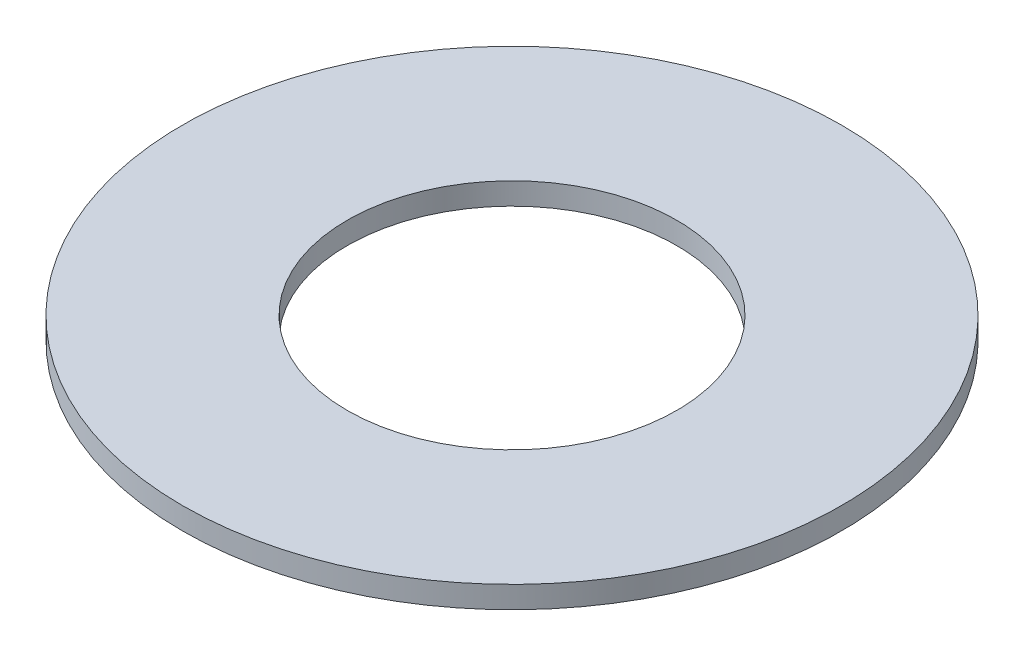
ISO-10303-21;
HEADER;
FILE_DESCRIPTION(('STEP AP214'),'2;1');
FILE_NAME('part.step','',(''),(''),'','','');
FILE_SCHEMA(('AUTOMOTIVE_DESIGN { 1 0 10303 214 1 1 1 1 }'));
ENDSEC;
DATA;
#1=APPLICATION_CONTEXT('core data for automotive mechanical design processes');
#2=APPLICATION_PROTOCOL_DEFINITION('international standard','automotive_design',2000,#1);
#3=PRODUCT_CONTEXT('',#1,'mechanical');
#4=PRODUCT('Part','Part','',(#3));
#5=PRODUCT_RELATED_PRODUCT_CATEGORY('part','',(#4));
#6=PRODUCT_DEFINITION_FORMATION('','',#4);
#7=PRODUCT_DEFINITION_CONTEXT('part definition',#1,'design');
#8=PRODUCT_DEFINITION('design','',#6,#7);
#9=PRODUCT_DEFINITION_SHAPE('','',#8);
#10=(LENGTH_UNIT() NAMED_UNIT(*) SI_UNIT(.MILLI.,.METRE.));
#11=(NAMED_UNIT(*) PLANE_ANGLE_UNIT() SI_UNIT($,.RADIAN.));
#12=(NAMED_UNIT(*) SI_UNIT($,.STERADIAN.) SOLID_ANGLE_UNIT());
#13=UNCERTAINTY_MEASURE_WITH_UNIT(LENGTH_MEASURE(1.E-05),#10,'distance_accuracy_value','');
#14=(GEOMETRIC_REPRESENTATION_CONTEXT(3) GLOBAL_UNCERTAINTY_ASSIGNED_CONTEXT((#13)) GLOBAL_UNIT_ASSIGNED_CONTEXT((#10,
#11,#12)) REPRESENTATION_CONTEXT('',''));
#15=CARTESIAN_POINT('',(0.,0.,0.));
#16=DIRECTION('',(0.,0.,1.));
#17=DIRECTION('',(1.,0.,0.));
#18=AXIS2_PLACEMENT_3D('',#15,#16,#17);
#19=CARTESIAN_POINT('',(0.,0.2,0.));
#20=DIRECTION('',(0.,1.,0.));
#21=DIRECTION('',(0.,0.,1.));
#22=AXIS2_PLACEMENT_3D('',#19,#20,#21);
#23=PLANE('',#22);
#24=CARTESIAN_POINT('',(0.,0.2,0.));
#25=DIRECTION('',(0.,1.,0.));
#26=DIRECTION('',(0.,0.,1.));
#27=AXIS2_PLACEMENT_3D('',#24,#25,#26);
#28=CIRCLE('',#27,3.);
#29=CARTESIAN_POINT('',(0.,0.2,3.));
#30=VERTEX_POINT('',#29);
#31=EDGE_CURVE('E10',#30,#30,#28,.T.);
#32=ORIENTED_EDGE('',*,*,#31,.T.);
#33=EDGE_LOOP('',(#32));
#34=FACE_BOUND('',#33,.T.);
#35=CARTESIAN_POINT('',(0.,0.2,0.));
#36=DIRECTION('',(0.,1.,0.));
#37=DIRECTION('',(0.,0.,1.));
#38=AXIS2_PLACEMENT_3D('',#35,#36,#37);
#39=CIRCLE('',#38,1.5);
#40=CARTESIAN_POINT('',(0.,0.2,1.5));
#41=VERTEX_POINT('',#40);
#42=EDGE_CURVE('E42',#41,#41,#39,.T.);
#43=ORIENTED_EDGE('',*,*,#42,.F.);
#44=EDGE_LOOP('',(#43));
#45=FACE_BOUND('',#44,.T.);
#46=ADVANCED_FACE('F31',(#34,#45),#23,.T.);
#47=CARTESIAN_POINT('',(0.,0.,0.));
#48=DIRECTION('',(0.,1.,0.));
#49=DIRECTION('',(0.,0.,1.));
#50=AXIS2_PLACEMENT_3D('',#47,#48,#49);
#51=PLANE('',#50);
#52=CARTESIAN_POINT('',(0.,0.,0.));
#53=DIRECTION('',(0.,1.,0.));
#54=DIRECTION('',(0.,0.,1.));
#55=AXIS2_PLACEMENT_3D('',#52,#53,#54);
#56=CIRCLE('',#55,3.);
#57=CARTESIAN_POINT('',(0.,0.,3.));
#58=VERTEX_POINT('',#57);
#59=EDGE_CURVE('E35',#58,#58,#56,.T.);
#60=ORIENTED_EDGE('',*,*,#59,.F.);
#61=EDGE_LOOP('',(#60));
#62=FACE_BOUND('',#61,.T.);
#63=CARTESIAN_POINT('',(0.,0.,0.));
#64=DIRECTION('',(0.,1.,0.));
#65=DIRECTION('',(0.,0.,1.));
#66=AXIS2_PLACEMENT_3D('',#63,#64,#65);
#67=CIRCLE('',#66,1.5);
#68=CARTESIAN_POINT('',(0.,0.,1.5));
#69=VERTEX_POINT('',#68);
#70=EDGE_CURVE('E44',#69,#69,#67,.T.);
#71=ORIENTED_EDGE('',*,*,#70,.T.);
#72=EDGE_LOOP('',(#71));
#73=FACE_BOUND('',#72,.T.);
#74=ADVANCED_FACE('F54',(#62,#73),#51,.F.);
#75=CARTESIAN_POINT('',(0.,0.2,0.));
#76=DIRECTION('',(0.,-1.,0.));
#77=DIRECTION('',(0.,0.,-1.));
#78=AXIS2_PLACEMENT_3D('',#75,#76,#77);
#79=CYLINDRICAL_SURFACE('',#78,3.);
#80=ORIENTED_EDGE('',*,*,#31,.F.);
#81=EDGE_LOOP('',(#80));
#82=FACE_BOUND('',#81,.T.);
#83=ORIENTED_EDGE('',*,*,#59,.T.);
#84=EDGE_LOOP('',(#83));
#85=FACE_BOUND('',#84,.T.);
#86=ADVANCED_FACE('F33',(#82,#85),#79,.T.);
#87=CARTESIAN_POINT('',(0.,0.2,0.));
#88=DIRECTION('',(0.,-1.,0.));
#89=DIRECTION('',(0.,0.,-1.));
#90=AXIS2_PLACEMENT_3D('',#87,#88,#89);
#91=CYLINDRICAL_SURFACE('',#90,1.5);
#92=ORIENTED_EDGE('',*,*,#42,.T.);
#93=EDGE_LOOP('',(#92));
#94=FACE_BOUND('',#93,.T.);
#95=ORIENTED_EDGE('',*,*,#70,.F.);
#96=EDGE_LOOP('',(#95));
#97=FACE_BOUND('',#96,.T.);
#98=ADVANCED_FACE('F50',(#94,#97),#91,.F.);
#99=CLOSED_SHELL('',(#46,#74,#86,#98));
#100=MANIFOLD_SOLID_BREP('B2',#99);
#101=ADVANCED_BREP_SHAPE_REPRESENTATION('',(#18,#100),#14);
#102=SHAPE_DEFINITION_REPRESENTATION(#9,#101);
ENDSEC;
END-ISO-10303-21;
